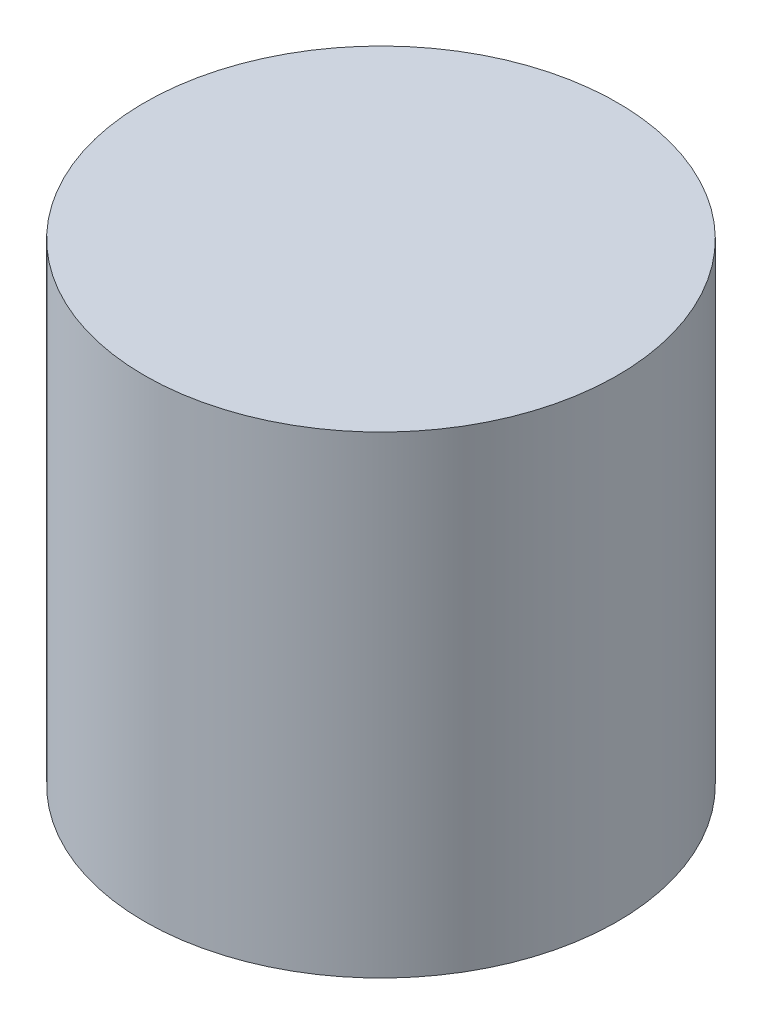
from build123d import *

# Parameters (mm, degrees)
SKIZZE1_R               = 5
LINEAR_AUSTRAGEN1_DEPTH = 10


with BuildPart() as part:
    # Skizze1 → Linear austragen1 (new body)
    with BuildSketch(Plane(origin=(0, 0, 0), x_dir=(1, 0, 0), z_dir=(0, 1, 0))):
        with Locations(Location((0, 0, 0), (0, 0, 270))):
            Circle(SKIZZE1_R)
    extrude(amount=LINEAR_AUSTRAGEN1_DEPTH)


solid = part.part
